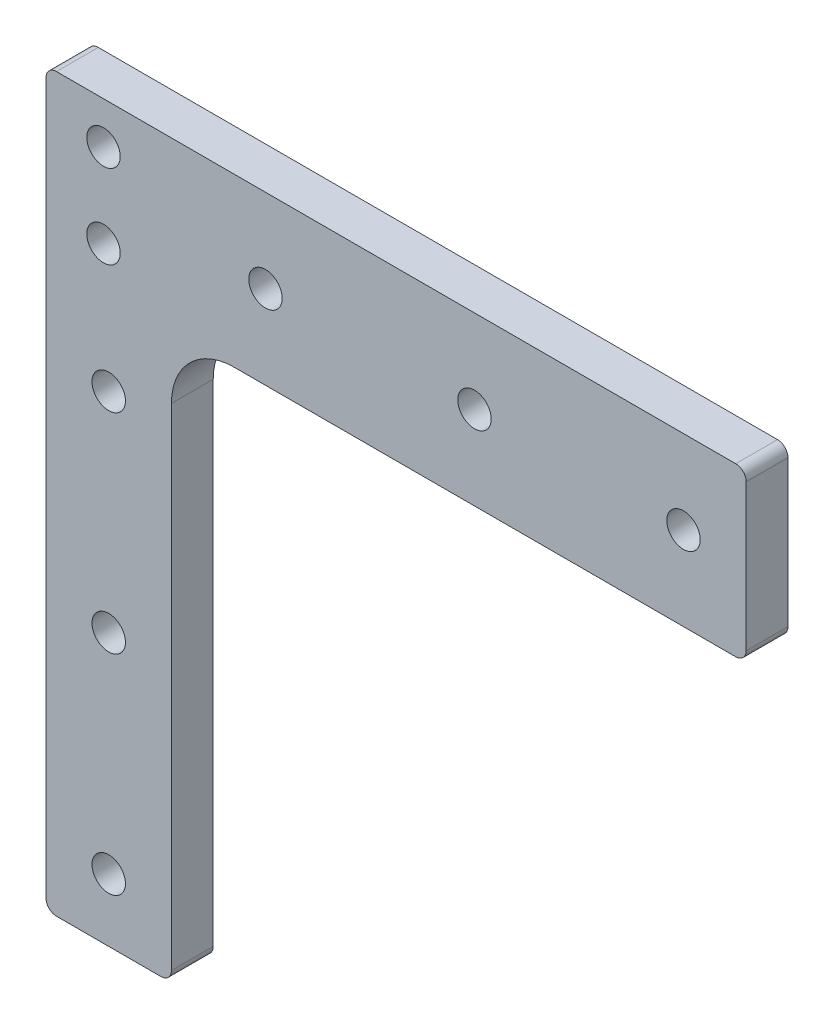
ISO-10303-21;
HEADER;
FILE_DESCRIPTION(('STEP AP214'),'2;1');
FILE_NAME('part.step','',(''),(''),'','','');
FILE_SCHEMA(('AUTOMOTIVE_DESIGN { 1 0 10303 214 1 1 1 1 }'));
ENDSEC;
DATA;
#1=APPLICATION_CONTEXT('core data for automotive mechanical design processes');
#2=APPLICATION_PROTOCOL_DEFINITION('international standard','automotive_design',2000,#1);
#3=PRODUCT_CONTEXT('',#1,'mechanical');
#4=PRODUCT('Part','Part','',(#3));
#5=PRODUCT_RELATED_PRODUCT_CATEGORY('part','',(#4));
#6=PRODUCT_DEFINITION_FORMATION('','',#4);
#7=PRODUCT_DEFINITION_CONTEXT('part definition',#1,'design');
#8=PRODUCT_DEFINITION('design','',#6,#7);
#9=PRODUCT_DEFINITION_SHAPE('','',#8);
#10=(LENGTH_UNIT() NAMED_UNIT(*) SI_UNIT(.MILLI.,.METRE.));
#11=(NAMED_UNIT(*) PLANE_ANGLE_UNIT() SI_UNIT($,.RADIAN.));
#12=(NAMED_UNIT(*) SI_UNIT($,.STERADIAN.) SOLID_ANGLE_UNIT());
#13=UNCERTAINTY_MEASURE_WITH_UNIT(LENGTH_MEASURE(1.E-05),#10,'distance_accuracy_value','');
#14=(GEOMETRIC_REPRESENTATION_CONTEXT(3) GLOBAL_UNCERTAINTY_ASSIGNED_CONTEXT((#13)) GLOBAL_UNIT_ASSIGNED_CONTEXT((#10,
#11,#12)) REPRESENTATION_CONTEXT('',''));
#15=CARTESIAN_POINT('',(0.,0.,0.));
#16=DIRECTION('',(0.,0.,1.));
#17=DIRECTION('',(1.,0.,0.));
#18=AXIS2_PLACEMENT_3D('',#15,#16,#17);
#19=CARTESIAN_POINT('',(0.,0.,4.));
#20=DIRECTION('',(0.,0.,1.));
#21=DIRECTION('',(1.,0.,0.));
#22=AXIS2_PLACEMENT_3D('',#19,#20,#21);
#23=PLANE('',#22);
#24=CARTESIAN_POINT('',(-15.0000000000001,-36.,4.));
#25=DIRECTION('',(0.,0.,1.));
#26=DIRECTION('',(1.,0.,0.));
#27=AXIS2_PLACEMENT_3D('',#24,#25,#26);
#28=CIRCLE('',#27,1.6);
#29=CARTESIAN_POINT('',(-13.4000000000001,-36.,4.));
#30=VERTEX_POINT('',#29);
#31=EDGE_CURVE('E274',#30,#30,#28,.T.);
#32=ORIENTED_EDGE('',*,*,#31,.F.);
#33=EDGE_LOOP('',(#32));
#34=FACE_BOUND('',#33,.T.);
#35=CARTESIAN_POINT('',(-15.5,-4.00000000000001,4.));
#36=DIRECTION('',(0.,0.,1.));
#37=DIRECTION('',(1.,0.,0.));
#38=AXIS2_PLACEMENT_3D('',#35,#36,#37);
#39=CIRCLE('',#38,1.6);
#40=CARTESIAN_POINT('',(-13.9,-4.00000000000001,4.));
#41=VERTEX_POINT('',#40);
#42=EDGE_CURVE('E262',#41,#41,#39,.T.);
#43=ORIENTED_EDGE('',*,*,#42,.F.);
#44=EDGE_LOOP('',(#43));
#45=FACE_BOUND('',#44,.T.);
#46=CARTESIAN_POINT('',(40.,0.,4.));
#47=DIRECTION('',(0.,0.,1.));
#48=DIRECTION('',(1.,0.,0.));
#49=AXIS2_PLACEMENT_3D('',#46,#47,#48);
#50=CIRCLE('',#49,1.6);
#51=CARTESIAN_POINT('',(41.6,0.,4.));
#52=VERTEX_POINT('',#51);
#53=EDGE_CURVE('E250',#52,#52,#50,.T.);
#54=ORIENTED_EDGE('',*,*,#53,.F.);
#55=EDGE_LOOP('',(#54));
#56=FACE_BOUND('',#55,.T.);
#57=CARTESIAN_POINT('',(0.,0.,4.));
#58=DIRECTION('',(0.,0.,1.));
#59=DIRECTION('',(1.,0.,0.));
#60=AXIS2_PLACEMENT_3D('',#57,#58,#59);
#61=CIRCLE('',#60,1.6);
#62=CARTESIAN_POINT('',(1.6,0.,4.));
#63=VERTEX_POINT('',#62);
#64=EDGE_CURVE('E235',#63,#63,#61,.T.);
#65=ORIENTED_EDGE('',*,*,#64,.F.);
#66=EDGE_LOOP('',(#65));
#67=FACE_BOUND('',#66,.T.);
#68=DIRECTION('',(1.,0.,0.));
#69=VECTOR('',#68,1.);
#70=CARTESIAN_POINT('',(-9.,-8.,4.));
#71=LINE('',#70,#69);
#72=CARTESIAN_POINT('',(-3.,-8.,4.));
#73=VERTEX_POINT('',#72);
#74=CARTESIAN_POINT('',(45.,-8.,4.));
#75=VERTEX_POINT('',#74);
#76=EDGE_CURVE('E152',#73,#75,#71,.T.);
#77=ORIENTED_EDGE('',*,*,#76,.T.);
#78=CARTESIAN_POINT('',(45.,-7.,4.));
#79=DIRECTION('',(0.,0.,1.));
#80=DIRECTION('',(1.,0.,0.));
#81=AXIS2_PLACEMENT_3D('',#78,#79,#80);
#82=CIRCLE('',#81,1.);
#83=CARTESIAN_POINT('',(46.,-7.,4.));
#84=VERTEX_POINT('',#83);
#85=EDGE_CURVE('E193',#75,#84,#82,.T.);
#86=ORIENTED_EDGE('',*,*,#85,.T.);
#87=DIRECTION('',(0.,1.,0.));
#88=VECTOR('',#87,1.);
#89=CARTESIAN_POINT('',(46.,8.,4.));
#90=LINE('',#89,#88);
#91=CARTESIAN_POINT('',(46.,7.,4.));
#92=VERTEX_POINT('',#91);
#93=EDGE_CURVE('E158',#84,#92,#90,.T.);
#94=ORIENTED_EDGE('',*,*,#93,.T.);
#95=CARTESIAN_POINT('',(45.,7.,4.));
#96=DIRECTION('',(0.,0.,1.));
#97=DIRECTION('',(1.,0.,0.));
#98=AXIS2_PLACEMENT_3D('',#95,#96,#97);
#99=CIRCLE('',#98,1.);
#100=CARTESIAN_POINT('',(45.,8.,4.));
#101=VERTEX_POINT('',#100);
#102=EDGE_CURVE('E191',#92,#101,#99,.T.);
#103=ORIENTED_EDGE('',*,*,#102,.T.);
#104=DIRECTION('',(-1.,0.,0.));
#105=VECTOR('',#104,1.);
#106=CARTESIAN_POINT('',(46.,8.,4.));
#107=LINE('',#106,#105);
#108=CARTESIAN_POINT('',(-20.,7.99999999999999,4.));
#109=VERTEX_POINT('',#108);
#110=EDGE_CURVE('E162',#101,#109,#107,.T.);
#111=ORIENTED_EDGE('',*,*,#110,.T.);
#112=CARTESIAN_POINT('',(-20.,6.99999999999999,4.));
#113=DIRECTION('',(0.,0.,1.));
#114=DIRECTION('',(1.,0.,0.));
#115=AXIS2_PLACEMENT_3D('',#112,#113,#114);
#116=CIRCLE('',#115,1.);
#117=CARTESIAN_POINT('',(-21.,6.99999999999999,4.));
#118=VERTEX_POINT('',#117);
#119=EDGE_CURVE('E186',#109,#118,#116,.T.);
#120=ORIENTED_EDGE('',*,*,#119,.T.);
#121=DIRECTION('',(0.,-1.,0.));
#122=VECTOR('',#121,1.);
#123=CARTESIAN_POINT('',(-21.,7.99999999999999,4.));
#124=LINE('',#123,#122);
#125=CARTESIAN_POINT('',(-21.,-61.,4.));
#126=VERTEX_POINT('',#125);
#127=EDGE_CURVE('E212',#118,#126,#124,.T.);
#128=ORIENTED_EDGE('',*,*,#127,.T.);
#129=CARTESIAN_POINT('',(-20.,-61.,4.));
#130=DIRECTION('',(0.,0.,1.));
#131=DIRECTION('',(1.,0.,0.));
#132=AXIS2_PLACEMENT_3D('',#129,#130,#131);
#133=CIRCLE('',#132,1.);
#134=CARTESIAN_POINT('',(-20.,-62.,4.));
#135=VERTEX_POINT('',#134);
#136=EDGE_CURVE('E189',#126,#135,#133,.T.);
#137=ORIENTED_EDGE('',*,*,#136,.T.);
#138=DIRECTION('',(1.,0.,0.));
#139=VECTOR('',#138,1.);
#140=CARTESIAN_POINT('',(-21.,-62.,4.));
#141=LINE('',#140,#139);
#142=CARTESIAN_POINT('',(-10.,-62.,4.));
#143=VERTEX_POINT('',#142);
#144=EDGE_CURVE('E221',#135,#143,#141,.T.);
#145=ORIENTED_EDGE('',*,*,#144,.T.);
#146=CARTESIAN_POINT('',(-10.,-61.,4.));
#147=DIRECTION('',(0.,0.,1.));
#148=DIRECTION('',(1.,0.,0.));
#149=AXIS2_PLACEMENT_3D('',#146,#147,#148);
#150=CIRCLE('',#149,1.);
#151=CARTESIAN_POINT('',(-9.,-61.,4.));
#152=VERTEX_POINT('',#151);
#153=EDGE_CURVE('E56',#143,#152,#150,.T.);
#154=ORIENTED_EDGE('',*,*,#153,.T.);
#155=DIRECTION('',(0.,1.,0.));
#156=VECTOR('',#155,1.);
#157=CARTESIAN_POINT('',(-9.,-62.,4.));
#158=LINE('',#157,#156);
#159=CARTESIAN_POINT('',(-9.,-14.,4.));
#160=VERTEX_POINT('',#159);
#161=EDGE_CURVE('E237',#152,#160,#158,.T.);
#162=ORIENTED_EDGE('',*,*,#161,.T.);
#163=CARTESIAN_POINT('',(-3.,-14.,4.));
#164=DIRECTION('',(0.,0.,1.));
#165=DIRECTION('',(1.,0.,0.));
#166=AXIS2_PLACEMENT_3D('',#163,#164,#165);
#167=CIRCLE('',#166,6.);
#168=EDGE_CURVE('E143',#160,#73,#167,.F.);
#169=ORIENTED_EDGE('',*,*,#168,.T.);
#170=EDGE_LOOP('',(#77,#86,#94,#103,#111,#120,#128,#137,#145,#154,#162,#169));
#171=FACE_BOUND('',#170,.T.);
#172=CARTESIAN_POINT('',(20.,0.,4.));
#173=DIRECTION('',(0.,0.,1.));
#174=DIRECTION('',(1.,0.,0.));
#175=AXIS2_PLACEMENT_3D('',#172,#173,#174);
#176=CIRCLE('',#175,1.6);
#177=CARTESIAN_POINT('',(21.6,0.,4.));
#178=VERTEX_POINT('',#177);
#179=EDGE_CURVE('E244',#178,#178,#176,.T.);
#180=ORIENTED_EDGE('',*,*,#179,.F.);
#181=EDGE_LOOP('',(#180));
#182=FACE_BOUND('',#181,.T.);
#183=CARTESIAN_POINT('',(-15.5,3.99999999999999,4.));
#184=DIRECTION('',(0.,0.,1.));
#185=DIRECTION('',(1.,0.,0.));
#186=AXIS2_PLACEMENT_3D('',#183,#184,#185);
#187=CIRCLE('',#186,1.6);
#188=CARTESIAN_POINT('',(-13.9,3.99999999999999,4.));
#189=VERTEX_POINT('',#188);
#190=EDGE_CURVE('E256',#189,#189,#187,.T.);
#191=ORIENTED_EDGE('',*,*,#190,.F.);
#192=EDGE_LOOP('',(#191));
#193=FACE_BOUND('',#192,.T.);
#194=CARTESIAN_POINT('',(-15.,-56.,4.));
#195=DIRECTION('',(0.,0.,1.));
#196=DIRECTION('',(1.,0.,0.));
#197=AXIS2_PLACEMENT_3D('',#194,#195,#196);
#198=CIRCLE('',#197,1.6);
#199=CARTESIAN_POINT('',(-13.4,-56.,4.));
#200=VERTEX_POINT('',#199);
#201=EDGE_CURVE('E268',#200,#200,#198,.T.);
#202=ORIENTED_EDGE('',*,*,#201,.F.);
#203=EDGE_LOOP('',(#202));
#204=FACE_BOUND('',#203,.T.);
#205=CARTESIAN_POINT('',(-15.0000000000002,-16.,4.));
#206=DIRECTION('',(0.,0.,1.));
#207=DIRECTION('',(1.,0.,0.));
#208=AXIS2_PLACEMENT_3D('',#205,#206,#207);
#209=CIRCLE('',#208,1.6);
#210=CARTESIAN_POINT('',(-13.4000000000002,-16.,4.));
#211=VERTEX_POINT('',#210);
#212=EDGE_CURVE('E280',#211,#211,#209,.T.);
#213=ORIENTED_EDGE('',*,*,#212,.F.);
#214=EDGE_LOOP('',(#213));
#215=FACE_BOUND('',#214,.T.);
#216=ADVANCED_FACE('F41',(#34,#45,#56,#67,#171,#182,#193,#204,#215),#23,.T.);
#217=CARTESIAN_POINT('',(0.,0.,0.));
#218=DIRECTION('',(0.,0.,1.));
#219=DIRECTION('',(1.,0.,0.));
#220=AXIS2_PLACEMENT_3D('',#217,#218,#219);
#221=PLANE('',#220);
#222=DIRECTION('',(0.,1.,0.));
#223=VECTOR('',#222,1.);
#224=CARTESIAN_POINT('',(46.,8.,0.));
#225=LINE('',#224,#223);
#226=CARTESIAN_POINT('',(46.,-7.,0.));
#227=VERTEX_POINT('',#226);
#228=CARTESIAN_POINT('',(46.,7.,0.));
#229=VERTEX_POINT('',#228);
#230=EDGE_CURVE('E232',#227,#229,#225,.T.);
#231=ORIENTED_EDGE('',*,*,#230,.F.);
#232=CARTESIAN_POINT('',(45.,-7.,0.));
#233=DIRECTION('',(0.,0.,1.));
#234=DIRECTION('',(1.,0.,0.));
#235=AXIS2_PLACEMENT_3D('',#232,#233,#234);
#236=CIRCLE('',#235,1.);
#237=CARTESIAN_POINT('',(45.,-8.,0.));
#238=VERTEX_POINT('',#237);
#239=EDGE_CURVE('E157',#227,#238,#236,.F.);
#240=ORIENTED_EDGE('',*,*,#239,.T.);
#241=DIRECTION('',(1.,0.,0.));
#242=VECTOR('',#241,1.);
#243=CARTESIAN_POINT('',(-9.,-8.,0.));
#244=LINE('',#243,#242);
#245=CARTESIAN_POINT('',(-3.,-8.,0.));
#246=VERTEX_POINT('',#245);
#247=EDGE_CURVE('E149',#246,#238,#244,.T.);
#248=ORIENTED_EDGE('',*,*,#247,.F.);
#249=CARTESIAN_POINT('',(-3.,-14.,0.));
#250=DIRECTION('',(0.,0.,1.));
#251=DIRECTION('',(1.,0.,0.));
#252=AXIS2_PLACEMENT_3D('',#249,#250,#251);
#253=CIRCLE('',#252,6.);
#254=CARTESIAN_POINT('',(-9.,-14.,0.));
#255=VERTEX_POINT('',#254);
#256=EDGE_CURVE('E133',#246,#255,#253,.T.);
#257=ORIENTED_EDGE('',*,*,#256,.T.);
#258=DIRECTION('',(0.,1.,0.));
#259=VECTOR('',#258,1.);
#260=CARTESIAN_POINT('',(-9.,-62.,0.));
#261=LINE('',#260,#259);
#262=CARTESIAN_POINT('',(-9.,-61.,0.));
#263=VERTEX_POINT('',#262);
#264=EDGE_CURVE('E159',#263,#255,#261,.T.);
#265=ORIENTED_EDGE('',*,*,#264,.F.);
#266=CARTESIAN_POINT('',(-10.,-61.,0.));
#267=DIRECTION('',(0.,0.,1.));
#268=DIRECTION('',(1.,0.,0.));
#269=AXIS2_PLACEMENT_3D('',#266,#267,#268);
#270=CIRCLE('',#269,1.);
#271=CARTESIAN_POINT('',(-10.,-62.,0.));
#272=VERTEX_POINT('',#271);
#273=EDGE_CURVE('E177',#263,#272,#270,.F.);
#274=ORIENTED_EDGE('',*,*,#273,.T.);
#275=DIRECTION('',(1.,0.,0.));
#276=VECTOR('',#275,1.);
#277=CARTESIAN_POINT('',(-21.,-62.,0.));
#278=LINE('',#277,#276);
#279=CARTESIAN_POINT('',(-20.,-62.,0.));
#280=VERTEX_POINT('',#279);
#281=EDGE_CURVE('E164',#280,#272,#278,.T.);
#282=ORIENTED_EDGE('',*,*,#281,.F.);
#283=CARTESIAN_POINT('',(-20.,-61.,0.));
#284=DIRECTION('',(0.,0.,1.));
#285=DIRECTION('',(1.,0.,0.));
#286=AXIS2_PLACEMENT_3D('',#283,#284,#285);
#287=CIRCLE('',#286,1.);
#288=CARTESIAN_POINT('',(-21.,-61.,0.));
#289=VERTEX_POINT('',#288);
#290=EDGE_CURVE('E179',#280,#289,#287,.F.);
#291=ORIENTED_EDGE('',*,*,#290,.T.);
#292=DIRECTION('',(0.,-1.,0.));
#293=VECTOR('',#292,1.);
#294=CARTESIAN_POINT('',(-21.,7.99999999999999,0.));
#295=LINE('',#294,#293);
#296=CARTESIAN_POINT('',(-21.,6.99999999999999,0.));
#297=VERTEX_POINT('',#296);
#298=EDGE_CURVE('E215',#297,#289,#295,.T.);
#299=ORIENTED_EDGE('',*,*,#298,.F.);
#300=CARTESIAN_POINT('',(-20.,6.99999999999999,0.));
#301=DIRECTION('',(0.,0.,1.));
#302=DIRECTION('',(1.,0.,0.));
#303=AXIS2_PLACEMENT_3D('',#300,#301,#302);
#304=CIRCLE('',#303,1.);
#305=CARTESIAN_POINT('',(-20.,7.99999999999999,0.));
#306=VERTEX_POINT('',#305);
#307=EDGE_CURVE('E175',#297,#306,#304,.F.);
#308=ORIENTED_EDGE('',*,*,#307,.T.);
#309=DIRECTION('',(-1.,0.,0.));
#310=VECTOR('',#309,1.);
#311=CARTESIAN_POINT('',(46.,8.,0.));
#312=LINE('',#311,#310);
#313=CARTESIAN_POINT('',(45.,8.,0.));
#314=VERTEX_POINT('',#313);
#315=EDGE_CURVE('E227',#314,#306,#312,.T.);
#316=ORIENTED_EDGE('',*,*,#315,.F.);
#317=CARTESIAN_POINT('',(45.,7.,0.));
#318=DIRECTION('',(0.,0.,1.));
#319=DIRECTION('',(1.,0.,0.));
#320=AXIS2_PLACEMENT_3D('',#317,#318,#319);
#321=CIRCLE('',#320,1.);
#322=EDGE_CURVE('E181',#314,#229,#321,.F.);
#323=ORIENTED_EDGE('',*,*,#322,.T.);
#324=EDGE_LOOP('',(#231,#240,#248,#257,#265,#274,#282,#291,#299,#308,#316,#323));
#325=FACE_BOUND('',#324,.T.);
#326=CARTESIAN_POINT('',(0.,0.,0.));
#327=DIRECTION('',(0.,0.,1.));
#328=DIRECTION('',(1.,0.,0.));
#329=AXIS2_PLACEMENT_3D('',#326,#327,#328);
#330=CIRCLE('',#329,1.6);
#331=CARTESIAN_POINT('',(1.6,0.,0.));
#332=VERTEX_POINT('',#331);
#333=EDGE_CURVE('E241',#332,#332,#330,.T.);
#334=ORIENTED_EDGE('',*,*,#333,.T.);
#335=EDGE_LOOP('',(#334));
#336=FACE_BOUND('',#335,.T.);
#337=CARTESIAN_POINT('',(20.,0.,0.));
#338=DIRECTION('',(0.,0.,1.));
#339=DIRECTION('',(1.,0.,0.));
#340=AXIS2_PLACEMENT_3D('',#337,#338,#339);
#341=CIRCLE('',#340,1.6);
#342=CARTESIAN_POINT('',(21.6,0.,0.));
#343=VERTEX_POINT('',#342);
#344=EDGE_CURVE('E247',#343,#343,#341,.T.);
#345=ORIENTED_EDGE('',*,*,#344,.T.);
#346=EDGE_LOOP('',(#345));
#347=FACE_BOUND('',#346,.T.);
#348=CARTESIAN_POINT('',(40.,0.,0.));
#349=DIRECTION('',(0.,0.,1.));
#350=DIRECTION('',(1.,0.,0.));
#351=AXIS2_PLACEMENT_3D('',#348,#349,#350);
#352=CIRCLE('',#351,1.6);
#353=CARTESIAN_POINT('',(41.6,0.,0.));
#354=VERTEX_POINT('',#353);
#355=EDGE_CURVE('E253',#354,#354,#352,.T.);
#356=ORIENTED_EDGE('',*,*,#355,.T.);
#357=EDGE_LOOP('',(#356));
#358=FACE_BOUND('',#357,.T.);
#359=CARTESIAN_POINT('',(-15.5,3.99999999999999,0.));
#360=DIRECTION('',(0.,0.,1.));
#361=DIRECTION('',(1.,0.,0.));
#362=AXIS2_PLACEMENT_3D('',#359,#360,#361);
#363=CIRCLE('',#362,1.6);
#364=CARTESIAN_POINT('',(-13.9,3.99999999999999,0.));
#365=VERTEX_POINT('',#364);
#366=EDGE_CURVE('E259',#365,#365,#363,.T.);
#367=ORIENTED_EDGE('',*,*,#366,.T.);
#368=EDGE_LOOP('',(#367));
#369=FACE_BOUND('',#368,.T.);
#370=CARTESIAN_POINT('',(-15.5,-4.00000000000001,0.));
#371=DIRECTION('',(0.,0.,1.));
#372=DIRECTION('',(1.,0.,0.));
#373=AXIS2_PLACEMENT_3D('',#370,#371,#372);
#374=CIRCLE('',#373,1.6);
#375=CARTESIAN_POINT('',(-13.9,-4.00000000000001,0.));
#376=VERTEX_POINT('',#375);
#377=EDGE_CURVE('E265',#376,#376,#374,.T.);
#378=ORIENTED_EDGE('',*,*,#377,.T.);
#379=EDGE_LOOP('',(#378));
#380=FACE_BOUND('',#379,.T.);
#381=CARTESIAN_POINT('',(-15.,-56.,0.));
#382=DIRECTION('',(0.,0.,1.));
#383=DIRECTION('',(1.,0.,0.));
#384=AXIS2_PLACEMENT_3D('',#381,#382,#383);
#385=CIRCLE('',#384,1.6);
#386=CARTESIAN_POINT('',(-13.4,-56.,0.));
#387=VERTEX_POINT('',#386);
#388=EDGE_CURVE('E271',#387,#387,#385,.T.);
#389=ORIENTED_EDGE('',*,*,#388,.T.);
#390=EDGE_LOOP('',(#389));
#391=FACE_BOUND('',#390,.T.);
#392=CARTESIAN_POINT('',(-15.0000000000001,-36.,0.));
#393=DIRECTION('',(0.,0.,1.));
#394=DIRECTION('',(1.,0.,0.));
#395=AXIS2_PLACEMENT_3D('',#392,#393,#394);
#396=CIRCLE('',#395,1.6);
#397=CARTESIAN_POINT('',(-13.4000000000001,-36.,0.));
#398=VERTEX_POINT('',#397);
#399=EDGE_CURVE('E277',#398,#398,#396,.T.);
#400=ORIENTED_EDGE('',*,*,#399,.T.);
#401=EDGE_LOOP('',(#400));
#402=FACE_BOUND('',#401,.T.);
#403=CARTESIAN_POINT('',(-15.0000000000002,-16.,0.));
#404=DIRECTION('',(0.,0.,1.));
#405=DIRECTION('',(1.,0.,0.));
#406=AXIS2_PLACEMENT_3D('',#403,#404,#405);
#407=CIRCLE('',#406,1.6);
#408=CARTESIAN_POINT('',(-13.4000000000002,-16.,0.));
#409=VERTEX_POINT('',#408);
#410=EDGE_CURVE('E283',#409,#409,#407,.T.);
#411=ORIENTED_EDGE('',*,*,#410,.T.);
#412=EDGE_LOOP('',(#411));
#413=FACE_BOUND('',#412,.T.);
#414=ADVANCED_FACE('F155',(#325,#336,#347,#358,#369,#380,#391,#402,#413),#221,.F.);
#415=CARTESIAN_POINT('',(46.,8.,4.));
#416=DIRECTION('',(-1.,0.,0.));
#417=DIRECTION('',(0.,0.,1.));
#418=AXIS2_PLACEMENT_3D('',#415,#416,#417);
#419=PLANE('',#418);
#420=ORIENTED_EDGE('',*,*,#93,.F.);
#421=DIRECTION('',(0.,0.,-1.));
#422=VECTOR('',#421,1.);
#423=CARTESIAN_POINT('',(46.,-7.,4.));
#424=LINE('',#423,#422);
#425=EDGE_CURVE('E172',#84,#227,#424,.T.);
#426=ORIENTED_EDGE('',*,*,#425,.T.);
#427=ORIENTED_EDGE('',*,*,#230,.T.);
#428=DIRECTION('',(0.,0.,-1.));
#429=VECTOR('',#428,1.);
#430=CARTESIAN_POINT('',(46.,7.,4.));
#431=LINE('',#430,#429);
#432=EDGE_CURVE('E170',#229,#92,#431,.F.);
#433=ORIENTED_EDGE('',*,*,#432,.T.);
#434=EDGE_LOOP('',(#420,#426,#427,#433));
#435=FACE_BOUND('',#434,.T.);
#436=ADVANCED_FACE('F299',(#435),#419,.F.);
#437=CARTESIAN_POINT('',(46.,8.,4.));
#438=DIRECTION('',(0.,-1.,0.));
#439=DIRECTION('',(1.,0.,0.));
#440=AXIS2_PLACEMENT_3D('',#437,#438,#439);
#441=PLANE('',#440);
#442=ORIENTED_EDGE('',*,*,#110,.F.);
#443=DIRECTION('',(0.,0.,-1.));
#444=VECTOR('',#443,1.);
#445=CARTESIAN_POINT('',(45.,8.,4.));
#446=LINE('',#445,#444);
#447=EDGE_CURVE('E197',#101,#314,#446,.T.);
#448=ORIENTED_EDGE('',*,*,#447,.T.);
#449=ORIENTED_EDGE('',*,*,#315,.T.);
#450=DIRECTION('',(0.,0.,-1.));
#451=VECTOR('',#450,1.);
#452=CARTESIAN_POINT('',(-20.,7.99999999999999,4.));
#453=LINE('',#452,#451);
#454=EDGE_CURVE('E195',#306,#109,#453,.F.);
#455=ORIENTED_EDGE('',*,*,#454,.T.);
#456=EDGE_LOOP('',(#442,#448,#449,#455));
#457=FACE_BOUND('',#456,.T.);
#458=ADVANCED_FACE('F317',(#457),#441,.F.);
#459=CARTESIAN_POINT('',(-21.,7.99999999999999,4.));
#460=DIRECTION('',(1.,0.,0.));
#461=DIRECTION('',(0.,1.,0.));
#462=AXIS2_PLACEMENT_3D('',#459,#460,#461);
#463=PLANE('',#462);
#464=ORIENTED_EDGE('',*,*,#298,.T.);
#465=DIRECTION('',(0.,0.,-1.));
#466=VECTOR('',#465,1.);
#467=CARTESIAN_POINT('',(-21.,-61.,4.));
#468=LINE('',#467,#466);
#469=EDGE_CURVE('E49',#289,#126,#468,.F.);
#470=ORIENTED_EDGE('',*,*,#469,.T.);
#471=ORIENTED_EDGE('',*,*,#127,.F.);
#472=DIRECTION('',(0.,0.,-1.));
#473=VECTOR('',#472,1.);
#474=CARTESIAN_POINT('',(-21.,6.99999999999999,4.));
#475=LINE('',#474,#473);
#476=EDGE_CURVE('E204',#118,#297,#475,.T.);
#477=ORIENTED_EDGE('',*,*,#476,.T.);
#478=EDGE_LOOP('',(#464,#470,#471,#477));
#479=FACE_BOUND('',#478,.T.);
#480=ADVANCED_FACE('F211',(#479),#463,.F.);
#481=CARTESIAN_POINT('',(-21.,-62.,4.));
#482=DIRECTION('',(0.,1.,0.));
#483=DIRECTION('',(0.,0.,1.));
#484=AXIS2_PLACEMENT_3D('',#481,#482,#483);
#485=PLANE('',#484);
#486=ORIENTED_EDGE('',*,*,#144,.F.);
#487=DIRECTION('',(0.,0.,-1.));
#488=VECTOR('',#487,1.);
#489=CARTESIAN_POINT('',(-20.,-62.,4.));
#490=LINE('',#489,#488);
#491=EDGE_CURVE('E201',#135,#280,#490,.T.);
#492=ORIENTED_EDGE('',*,*,#491,.T.);
#493=ORIENTED_EDGE('',*,*,#281,.T.);
#494=DIRECTION('',(0.,0.,-1.));
#495=VECTOR('',#494,1.);
#496=CARTESIAN_POINT('',(-10.,-62.,4.));
#497=LINE('',#496,#495);
#498=EDGE_CURVE('E64',#272,#143,#497,.F.);
#499=ORIENTED_EDGE('',*,*,#498,.T.);
#500=EDGE_LOOP('',(#486,#492,#493,#499));
#501=FACE_BOUND('',#500,.T.);
#502=ADVANCED_FACE('F226',(#501),#485,.F.);
#503=CARTESIAN_POINT('',(-9.,-62.,4.));
#504=DIRECTION('',(-1.,0.,0.));
#505=DIRECTION('',(0.,0.,1.));
#506=AXIS2_PLACEMENT_3D('',#503,#504,#505);
#507=PLANE('',#506);
#508=ORIENTED_EDGE('',*,*,#161,.F.);
#509=DIRECTION('',(0.,0.,-1.));
#510=VECTOR('',#509,1.);
#511=CARTESIAN_POINT('',(-9.,-61.,4.));
#512=LINE('',#511,#510);
#513=EDGE_CURVE('E11',#152,#263,#512,.T.);
#514=ORIENTED_EDGE('',*,*,#513,.T.);
#515=ORIENTED_EDGE('',*,*,#264,.T.);
#516=DIRECTION('',(0.,0.,-1.));
#517=VECTOR('',#516,1.);
#518=CARTESIAN_POINT('',(-9.,-14.,4.));
#519=LINE('',#518,#517);
#520=EDGE_CURVE('E139',#255,#160,#519,.F.);
#521=ORIENTED_EDGE('',*,*,#520,.T.);
#522=EDGE_LOOP('',(#508,#514,#515,#521));
#523=FACE_BOUND('',#522,.T.);
#524=ADVANCED_FACE('F309',(#523),#507,.F.);
#525=CARTESIAN_POINT('',(-9.,-8.,4.));
#526=DIRECTION('',(0.,1.,0.));
#527=DIRECTION('',(0.,0.,1.));
#528=AXIS2_PLACEMENT_3D('',#525,#526,#527);
#529=PLANE('',#528);
#530=ORIENTED_EDGE('',*,*,#247,.T.);
#531=DIRECTION('',(0.,0.,-1.));
#532=VECTOR('',#531,1.);
#533=CARTESIAN_POINT('',(45.,-8.,4.));
#534=LINE('',#533,#532);
#535=EDGE_CURVE('E184',#238,#75,#534,.F.);
#536=ORIENTED_EDGE('',*,*,#535,.T.);
#537=ORIENTED_EDGE('',*,*,#76,.F.);
#538=DIRECTION('',(0.,0.,-1.));
#539=VECTOR('',#538,1.);
#540=CARTESIAN_POINT('',(-3.,-8.,0.));
#541=LINE('',#540,#539);
#542=EDGE_CURVE('E137',#73,#246,#541,.T.);
#543=ORIENTED_EDGE('',*,*,#542,.T.);
#544=EDGE_LOOP('',(#530,#536,#537,#543));
#545=FACE_BOUND('',#544,.T.);
#546=ADVANCED_FACE('F148',(#545),#529,.F.);
#547=CARTESIAN_POINT('',(0.,0.,4.));
#548=DIRECTION('',(0.,0.,-1.));
#549=DIRECTION('',(-1.,0.,0.));
#550=AXIS2_PLACEMENT_3D('',#547,#548,#549);
#551=CYLINDRICAL_SURFACE('',#550,1.6);
#552=ORIENTED_EDGE('',*,*,#64,.T.);
#553=EDGE_LOOP('',(#552));
#554=FACE_BOUND('',#553,.T.);
#555=ORIENTED_EDGE('',*,*,#333,.F.);
#556=EDGE_LOOP('',(#555));
#557=FACE_BOUND('',#556,.T.);
#558=ADVANCED_FACE('F304',(#554,#557),#551,.F.);
#559=CARTESIAN_POINT('',(20.,0.,4.));
#560=DIRECTION('',(0.,0.,-1.));
#561=DIRECTION('',(-1.,0.,0.));
#562=AXIS2_PLACEMENT_3D('',#559,#560,#561);
#563=CYLINDRICAL_SURFACE('',#562,1.6);
#564=ORIENTED_EDGE('',*,*,#179,.T.);
#565=EDGE_LOOP('',(#564));
#566=FACE_BOUND('',#565,.T.);
#567=ORIENTED_EDGE('',*,*,#344,.F.);
#568=EDGE_LOOP('',(#567));
#569=FACE_BOUND('',#568,.T.);
#570=ADVANCED_FACE('F440',(#566,#569),#563,.F.);
#571=CARTESIAN_POINT('',(40.,0.,4.));
#572=DIRECTION('',(0.,0.,-1.));
#573=DIRECTION('',(-1.,0.,0.));
#574=AXIS2_PLACEMENT_3D('',#571,#572,#573);
#575=CYLINDRICAL_SURFACE('',#574,1.6);
#576=ORIENTED_EDGE('',*,*,#53,.T.);
#577=EDGE_LOOP('',(#576));
#578=FACE_BOUND('',#577,.T.);
#579=ORIENTED_EDGE('',*,*,#355,.F.);
#580=EDGE_LOOP('',(#579));
#581=FACE_BOUND('',#580,.T.);
#582=ADVANCED_FACE('F430',(#578,#581),#575,.F.);
#583=CARTESIAN_POINT('',(-15.5,3.99999999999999,4.));
#584=DIRECTION('',(0.,0.,-1.));
#585=DIRECTION('',(-1.,0.,0.));
#586=AXIS2_PLACEMENT_3D('',#583,#584,#585);
#587=CYLINDRICAL_SURFACE('',#586,1.6);
#588=ORIENTED_EDGE('',*,*,#190,.T.);
#589=EDGE_LOOP('',(#588));
#590=FACE_BOUND('',#589,.T.);
#591=ORIENTED_EDGE('',*,*,#366,.F.);
#592=EDGE_LOOP('',(#591));
#593=FACE_BOUND('',#592,.T.);
#594=ADVANCED_FACE('F420',(#590,#593),#587,.F.);
#595=CARTESIAN_POINT('',(-15.5,-4.00000000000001,4.));
#596=DIRECTION('',(0.,0.,-1.));
#597=DIRECTION('',(-1.,0.,0.));
#598=AXIS2_PLACEMENT_3D('',#595,#596,#597);
#599=CYLINDRICAL_SURFACE('',#598,1.6);
#600=ORIENTED_EDGE('',*,*,#42,.T.);
#601=EDGE_LOOP('',(#600));
#602=FACE_BOUND('',#601,.T.);
#603=ORIENTED_EDGE('',*,*,#377,.F.);
#604=EDGE_LOOP('',(#603));
#605=FACE_BOUND('',#604,.T.);
#606=ADVANCED_FACE('F410',(#602,#605),#599,.F.);
#607=CARTESIAN_POINT('',(-15.,-56.,4.));
#608=DIRECTION('',(0.,0.,-1.));
#609=DIRECTION('',(-1.,0.,0.));
#610=AXIS2_PLACEMENT_3D('',#607,#608,#609);
#611=CYLINDRICAL_SURFACE('',#610,1.6);
#612=ORIENTED_EDGE('',*,*,#201,.T.);
#613=EDGE_LOOP('',(#612));
#614=FACE_BOUND('',#613,.T.);
#615=ORIENTED_EDGE('',*,*,#388,.F.);
#616=EDGE_LOOP('',(#615));
#617=FACE_BOUND('',#616,.T.);
#618=ADVANCED_FACE('F400',(#614,#617),#611,.F.);
#619=CARTESIAN_POINT('',(-15.0000000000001,-36.,4.));
#620=DIRECTION('',(0.,0.,-1.));
#621=DIRECTION('',(-1.,0.,0.));
#622=AXIS2_PLACEMENT_3D('',#619,#620,#621);
#623=CYLINDRICAL_SURFACE('',#622,1.6);
#624=ORIENTED_EDGE('',*,*,#31,.T.);
#625=EDGE_LOOP('',(#624));
#626=FACE_BOUND('',#625,.T.);
#627=ORIENTED_EDGE('',*,*,#399,.F.);
#628=EDGE_LOOP('',(#627));
#629=FACE_BOUND('',#628,.T.);
#630=ADVANCED_FACE('F391',(#626,#629),#623,.F.);
#631=CARTESIAN_POINT('',(-15.0000000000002,-16.,4.));
#632=DIRECTION('',(0.,0.,-1.));
#633=DIRECTION('',(-1.,0.,0.));
#634=AXIS2_PLACEMENT_3D('',#631,#632,#633);
#635=CYLINDRICAL_SURFACE('',#634,1.6);
#636=ORIENTED_EDGE('',*,*,#212,.T.);
#637=EDGE_LOOP('',(#636));
#638=FACE_BOUND('',#637,.T.);
#639=ORIENTED_EDGE('',*,*,#410,.F.);
#640=EDGE_LOOP('',(#639));
#641=FACE_BOUND('',#640,.T.);
#642=ADVANCED_FACE('F289',(#638,#641),#635,.F.);
#643=CARTESIAN_POINT('',(-3.,-14.,4.));
#644=DIRECTION('',(0.,0.,1.));
#645=DIRECTION('',(1.,0.,0.));
#646=AXIS2_PLACEMENT_3D('',#643,#644,#645);
#647=CYLINDRICAL_SURFACE('',#646,6.);
#648=ORIENTED_EDGE('',*,*,#168,.F.);
#649=ORIENTED_EDGE('',*,*,#520,.F.);
#650=ORIENTED_EDGE('',*,*,#256,.F.);
#651=ORIENTED_EDGE('',*,*,#542,.F.);
#652=EDGE_LOOP('',(#648,#649,#650,#651));
#653=FACE_BOUND('',#652,.T.);
#654=ADVANCED_FACE('F136',(#653),#647,.F.);
#655=CARTESIAN_POINT('',(45.,-7.,4.));
#656=DIRECTION('',(0.,0.,-1.));
#657=DIRECTION('',(-1.,0.,0.));
#658=AXIS2_PLACEMENT_3D('',#655,#656,#657);
#659=CYLINDRICAL_SURFACE('',#658,1.);
#660=ORIENTED_EDGE('',*,*,#85,.F.);
#661=ORIENTED_EDGE('',*,*,#535,.F.);
#662=ORIENTED_EDGE('',*,*,#239,.F.);
#663=ORIENTED_EDGE('',*,*,#425,.F.);
#664=EDGE_LOOP('',(#660,#661,#662,#663));
#665=FACE_BOUND('',#664,.T.);
#666=ADVANCED_FACE('F325',(#665),#659,.T.);
#667=CARTESIAN_POINT('',(45.,7.,4.));
#668=DIRECTION('',(0.,0.,-1.));
#669=DIRECTION('',(-1.,0.,0.));
#670=AXIS2_PLACEMENT_3D('',#667,#668,#669);
#671=CYLINDRICAL_SURFACE('',#670,1.);
#672=ORIENTED_EDGE('',*,*,#102,.F.);
#673=ORIENTED_EDGE('',*,*,#432,.F.);
#674=ORIENTED_EDGE('',*,*,#322,.F.);
#675=ORIENTED_EDGE('',*,*,#447,.F.);
#676=EDGE_LOOP('',(#672,#673,#674,#675));
#677=FACE_BOUND('',#676,.T.);
#678=ADVANCED_FACE('F328',(#677),#671,.T.);
#679=CARTESIAN_POINT('',(-20.,-61.,4.));
#680=DIRECTION('',(0.,0.,-1.));
#681=DIRECTION('',(-1.,0.,0.));
#682=AXIS2_PLACEMENT_3D('',#679,#680,#681);
#683=CYLINDRICAL_SURFACE('',#682,1.);
#684=ORIENTED_EDGE('',*,*,#136,.F.);
#685=ORIENTED_EDGE('',*,*,#469,.F.);
#686=ORIENTED_EDGE('',*,*,#290,.F.);
#687=ORIENTED_EDGE('',*,*,#491,.F.);
#688=EDGE_LOOP('',(#684,#685,#686,#687));
#689=FACE_BOUND('',#688,.T.);
#690=ADVANCED_FACE('F224',(#689),#683,.T.);
#691=CARTESIAN_POINT('',(-10.,-61.,4.));
#692=DIRECTION('',(0.,0.,-1.));
#693=DIRECTION('',(-1.,0.,0.));
#694=AXIS2_PLACEMENT_3D('',#691,#692,#693);
#695=CYLINDRICAL_SURFACE('',#694,1.);
#696=ORIENTED_EDGE('',*,*,#153,.F.);
#697=ORIENTED_EDGE('',*,*,#498,.F.);
#698=ORIENTED_EDGE('',*,*,#273,.F.);
#699=ORIENTED_EDGE('',*,*,#513,.F.);
#700=EDGE_LOOP('',(#696,#697,#698,#699));
#701=FACE_BOUND('',#700,.T.);
#702=ADVANCED_FACE('F334',(#701),#695,.T.);
#703=CARTESIAN_POINT('',(-20.,6.99999999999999,4.));
#704=DIRECTION('',(0.,0.,-1.));
#705=DIRECTION('',(-1.,0.,0.));
#706=AXIS2_PLACEMENT_3D('',#703,#704,#705);
#707=CYLINDRICAL_SURFACE('',#706,1.);
#708=ORIENTED_EDGE('',*,*,#119,.F.);
#709=ORIENTED_EDGE('',*,*,#454,.F.);
#710=ORIENTED_EDGE('',*,*,#307,.F.);
#711=ORIENTED_EDGE('',*,*,#476,.F.);
#712=EDGE_LOOP('',(#708,#709,#710,#711));
#713=FACE_BOUND('',#712,.T.);
#714=ADVANCED_FACE('F43',(#713),#707,.T.);
#715=CLOSED_SHELL('',(#216,#414,#436,#458,#480,#502,#524,#546,#558,#570,#582,#594,#606,#618,
#630,#642,#654,#666,#678,#690,#702,#714));
#716=MANIFOLD_SOLID_BREP('B2',#715);
#717=ADVANCED_BREP_SHAPE_REPRESENTATION('',(#18,#716),#14);
#718=SHAPE_DEFINITION_REPRESENTATION(#9,#717);
ENDSEC;
END-ISO-10303-21;
